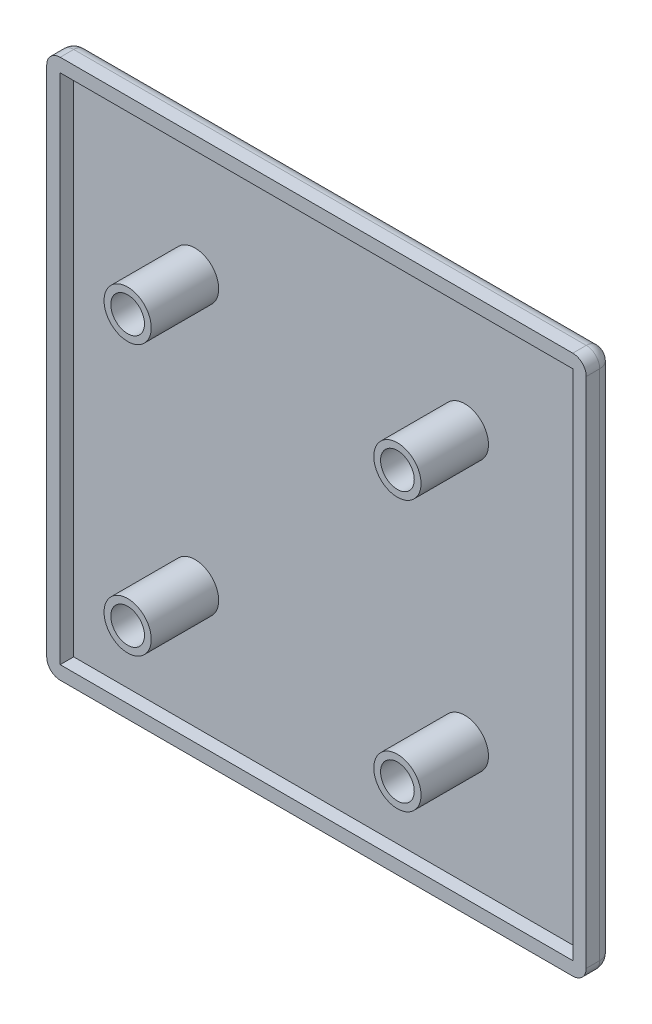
from build123d import *

# Parameters (mm, degrees)
SKETCH_1_W      = 80
SKETCH_1_H      = 80
EXTRUDE_1_DEPTH = 2
SHELL_2_T       = -2
SKETCH_2_R      = 3.5
SKETCH_2_R_2    = 2.5
EXTRUDE_2_DEPTH = 10
FILLET_1_R      = 2


with BuildPart() as part:
    # Sketch 1 → Extrude 1 (new, symmetric)
    with BuildSketch(Plane.XY):
        Rectangle(SKETCH_1_W, SKETCH_1_H)
    extrude(amount=EXTRUDE_1_DEPTH, both=True)

    # Shell 2
    shell_2_openings = [part.faces().sort_by_distance(p)[0] for p in [
        (0, 0, 2),
    ]]
    offset(amount=SHELL_2_T, openings=shell_2_openings, kind=Kind.INTERSECTION)

    # Sketch 2 → Extrude 2 (add)
    # profile 1 of 4: a face of its own
    with BuildSketch(Plane.XY):
        with Locations((-20, 20)):
            Circle(SKETCH_2_R)
        with Locations((-20, 20)):
            Circle(SKETCH_2_R_2, mode=Mode.SUBTRACT)
    # profile 2 of 4: a face of its own
    with BuildSketch(Plane.XY):
        with Locations((-20, -20)):
            Circle(SKETCH_2_R)
        with Locations((-20, -20)):
            Circle(SKETCH_2_R_2, mode=Mode.SUBTRACT)
    # profile 3 of 4: a face of its own
    with BuildSketch(Plane.XY):
        with Locations((20, 20)):
            Circle(SKETCH_2_R)
        with Locations((20, 20)):
            Circle(SKETCH_2_R_2, mode=Mode.SUBTRACT)
    # profile 4 of 4: a face of its own
    with BuildSketch(Plane.XY):
        with Locations((20, -20)):
            Circle(SKETCH_2_R)
        with Locations((20, -20)):
            Circle(SKETCH_2_R_2, mode=Mode.SUBTRACT)
    extrude(amount=EXTRUDE_2_DEPTH)

    # Fillet 1
    fillet_1_edges = [part.edges().sort_by_distance(p)[0] for p in [
        (0, 40, -2),
        (40, 0, -2),
        (0, -40, -2),
        (-40, 0, -2),
        (-40, 40, 0),
        (40, 40, 0),
        (40, -40, 0),
        (-40, -40, 0),
    ]]
    fillet(fillet_1_edges, radius=FILLET_1_R)


solid = part.part
